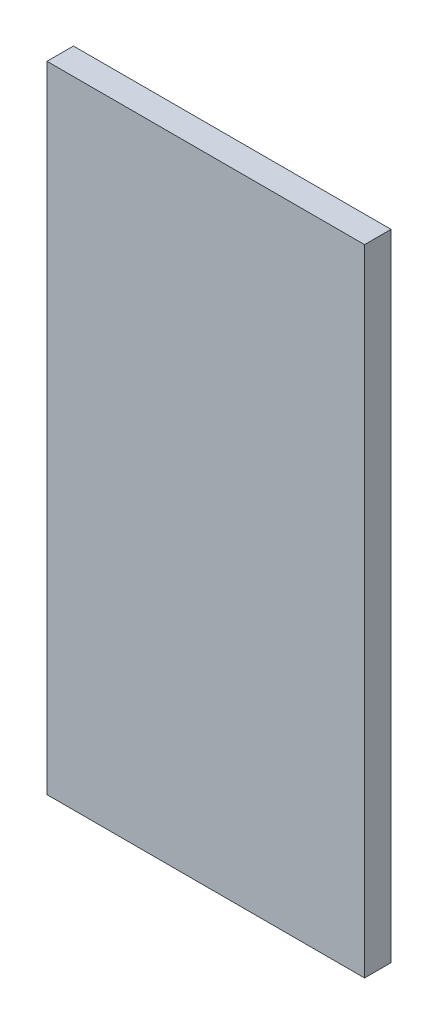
ISO-10303-21;
HEADER;
FILE_DESCRIPTION(('STEP AP214'),'2;1');
FILE_NAME('part.step','',(''),(''),'','','');
FILE_SCHEMA(('AUTOMOTIVE_DESIGN { 1 0 10303 214 1 1 1 1 }'));
ENDSEC;
DATA;
#1=APPLICATION_CONTEXT('core data for automotive mechanical design processes');
#2=APPLICATION_PROTOCOL_DEFINITION('international standard','automotive_design',2000,#1);
#3=PRODUCT_CONTEXT('',#1,'mechanical');
#4=PRODUCT('Part','Part','',(#3));
#5=PRODUCT_RELATED_PRODUCT_CATEGORY('part','',(#4));
#6=PRODUCT_DEFINITION_FORMATION('','',#4);
#7=PRODUCT_DEFINITION_CONTEXT('part definition',#1,'design');
#8=PRODUCT_DEFINITION('design','',#6,#7);
#9=PRODUCT_DEFINITION_SHAPE('','',#8);
#10=(LENGTH_UNIT() NAMED_UNIT(*) SI_UNIT(.MILLI.,.METRE.));
#11=(NAMED_UNIT(*) PLANE_ANGLE_UNIT() SI_UNIT($,.RADIAN.));
#12=(NAMED_UNIT(*) SI_UNIT($,.STERADIAN.) SOLID_ANGLE_UNIT());
#13=UNCERTAINTY_MEASURE_WITH_UNIT(LENGTH_MEASURE(1.E-05),#10,'distance_accuracy_value','');
#14=(GEOMETRIC_REPRESENTATION_CONTEXT(3) GLOBAL_UNCERTAINTY_ASSIGNED_CONTEXT((#13)) GLOBAL_UNIT_ASSIGNED_CONTEXT((#10,
#11,#12)) REPRESENTATION_CONTEXT('',''));
#15=CARTESIAN_POINT('',(0.,0.,0.));
#16=DIRECTION('',(0.,0.,1.));
#17=DIRECTION('',(1.,0.,0.));
#18=AXIS2_PLACEMENT_3D('',#15,#16,#17);
#19=CARTESIAN_POINT('',(609.6,0.,-50.8));
#20=DIRECTION('',(0.,1.,0.));
#21=DIRECTION('',(0.,0.,1.));
#22=AXIS2_PLACEMENT_3D('',#19,#20,#21);
#23=PLANE('',#22);
#24=DIRECTION('',(0.,0.,-1.));
#25=VECTOR('',#24,1.);
#26=CARTESIAN_POINT('',(0.,0.,-50.8));
#27=LINE('',#26,#25);
#28=CARTESIAN_POINT('',(0.,0.,0.));
#29=VERTEX_POINT('',#28);
#30=CARTESIAN_POINT('',(0.,0.,-50.8));
#31=VERTEX_POINT('',#30);
#32=EDGE_CURVE('E148',#29,#31,#27,.T.);
#33=ORIENTED_EDGE('',*,*,#32,.T.);
#34=DIRECTION('',(-1.,0.,0.));
#35=VECTOR('',#34,1.);
#36=CARTESIAN_POINT('',(609.6,0.,-50.8));
#37=LINE('',#36,#35);
#38=CARTESIAN_POINT('',(609.6,0.,-50.8));
#39=VERTEX_POINT('',#38);
#40=EDGE_CURVE('E11',#39,#31,#37,.T.);
#41=ORIENTED_EDGE('',*,*,#40,.F.);
#42=DIRECTION('',(0.,0.,-1.));
#43=VECTOR('',#42,1.);
#44=CARTESIAN_POINT('',(609.6,0.,-50.8));
#45=LINE('',#44,#43);
#46=CARTESIAN_POINT('',(609.6,0.,0.));
#47=VERTEX_POINT('',#46);
#48=EDGE_CURVE('E161',#47,#39,#45,.T.);
#49=ORIENTED_EDGE('',*,*,#48,.F.);
#50=DIRECTION('',(-1.,0.,0.));
#51=VECTOR('',#50,1.);
#52=CARTESIAN_POINT('',(609.6,0.,0.));
#53=LINE('',#52,#51);
#54=EDGE_CURVE('E162',#47,#29,#53,.T.);
#55=ORIENTED_EDGE('',*,*,#54,.T.);
#56=EDGE_LOOP('',(#33,#41,#49,#55));
#57=FACE_BOUND('',#56,.T.);
#58=ADVANCED_FACE('F32',(#57),#23,.F.);
#59=CARTESIAN_POINT('',(609.6,50.8,-101.6));
#60=DIRECTION('',(0.,1.,0.));
#61=DIRECTION('',(0.,0.,1.));
#62=AXIS2_PLACEMENT_3D('',#59,#60,#61);
#63=PLANE('',#62);
#64=DIRECTION('',(-1.,0.,0.));
#65=VECTOR('',#64,1.);
#66=CARTESIAN_POINT('',(609.6,50.8,-101.6));
#67=LINE('',#66,#65);
#68=CARTESIAN_POINT('',(533.4,50.8,-101.6));
#69=VERTEX_POINT('',#68);
#70=CARTESIAN_POINT('',(0.,50.8,-101.6));
#71=VERTEX_POINT('',#70);
#72=EDGE_CURVE('E129',#69,#71,#67,.T.);
#73=ORIENTED_EDGE('',*,*,#72,.F.);
#74=DIRECTION('',(0.,0.,-1.));
#75=VECTOR('',#74,1.);
#76=CARTESIAN_POINT('',(533.4,50.8,-50.8));
#77=LINE('',#76,#75);
#78=CARTESIAN_POINT('',(533.4,50.8,-50.8));
#79=VERTEX_POINT('',#78);
#80=EDGE_CURVE('E112',#79,#69,#77,.T.);
#81=ORIENTED_EDGE('',*,*,#80,.F.);
#82=DIRECTION('',(-1.,0.,0.));
#83=VECTOR('',#82,1.);
#84=CARTESIAN_POINT('',(609.6,50.8,-50.8));
#85=LINE('',#84,#83);
#86=CARTESIAN_POINT('',(0.,50.8,-50.8));
#87=VERTEX_POINT('',#86);
#88=EDGE_CURVE('E40',#79,#87,#85,.T.);
#89=ORIENTED_EDGE('',*,*,#88,.T.);
#90=DIRECTION('',(0.,0.,-1.));
#91=VECTOR('',#90,1.);
#92=CARTESIAN_POINT('',(0.,50.8,-101.6));
#93=LINE('',#92,#91);
#94=EDGE_CURVE('E141',#87,#71,#93,.T.);
#95=ORIENTED_EDGE('',*,*,#94,.T.);
#96=EDGE_LOOP('',(#73,#81,#89,#95));
#97=FACE_BOUND('',#96,.T.);
#98=ADVANCED_FACE('F139',(#97),#63,.F.);
#99=CARTESIAN_POINT('',(609.6,1168.4,-101.6));
#100=DIRECTION('',(0.,0.,1.));
#101=DIRECTION('',(0.,-1.,0.));
#102=AXIS2_PLACEMENT_3D('',#99,#100,#101);
#103=PLANE('',#102);
#104=DIRECTION('',(-1.,0.,0.));
#105=VECTOR('',#104,1.);
#106=CARTESIAN_POINT('',(609.6,1168.4,-101.6));
#107=LINE('',#106,#105);
#108=CARTESIAN_POINT('',(533.4,1168.4,-101.6));
#109=VERTEX_POINT('',#108);
#110=CARTESIAN_POINT('',(0.,1168.4,-101.6));
#111=VERTEX_POINT('',#110);
#112=EDGE_CURVE('E121',#109,#111,#107,.T.);
#113=ORIENTED_EDGE('',*,*,#112,.F.);
#114=DIRECTION('',(0.,1.,0.));
#115=VECTOR('',#114,1.);
#116=CARTESIAN_POINT('',(533.4,-0.000999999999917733,-101.6));
#117=LINE('',#116,#115);
#118=EDGE_CURVE('E106',#69,#109,#117,.T.);
#119=ORIENTED_EDGE('',*,*,#118,.F.);
#120=ORIENTED_EDGE('',*,*,#72,.T.);
#121=DIRECTION('',(0.,1.,0.));
#122=VECTOR('',#121,1.);
#123=CARTESIAN_POINT('',(0.,1168.4,-101.6));
#124=LINE('',#123,#122);
#125=EDGE_CURVE('E127',#71,#111,#124,.T.);
#126=ORIENTED_EDGE('',*,*,#125,.T.);
#127=EDGE_LOOP('',(#113,#119,#120,#126));
#128=FACE_BOUND('',#127,.T.);
#129=ADVANCED_FACE('F125',(#128),#103,.F.);
#130=CARTESIAN_POINT('',(609.6,1168.4,-50.8));
#131=DIRECTION('',(0.,-1.,0.));
#132=DIRECTION('',(0.,0.,-1.));
#133=AXIS2_PLACEMENT_3D('',#130,#131,#132);
#134=PLANE('',#133);
#135=DIRECTION('',(-1.,0.,0.));
#136=VECTOR('',#135,1.);
#137=CARTESIAN_POINT('',(609.6,1168.4,-50.8));
#138=LINE('',#137,#136);
#139=CARTESIAN_POINT('',(533.4,1168.4,-50.8));
#140=VERTEX_POINT('',#139);
#141=CARTESIAN_POINT('',(0.,1168.4,-50.8));
#142=VERTEX_POINT('',#141);
#143=EDGE_CURVE('E123',#140,#142,#138,.T.);
#144=ORIENTED_EDGE('',*,*,#143,.F.);
#145=DIRECTION('',(0.,0.,1.));
#146=VECTOR('',#145,1.);
#147=CARTESIAN_POINT('',(533.4,1168.4,-50.8));
#148=LINE('',#147,#146);
#149=EDGE_CURVE('E109',#109,#140,#148,.T.);
#150=ORIENTED_EDGE('',*,*,#149,.F.);
#151=ORIENTED_EDGE('',*,*,#112,.T.);
#152=DIRECTION('',(0.,0.,1.));
#153=VECTOR('',#152,1.);
#154=CARTESIAN_POINT('',(0.,1168.4,-50.8));
#155=LINE('',#154,#153);
#156=EDGE_CURVE('E152',#111,#142,#155,.T.);
#157=ORIENTED_EDGE('',*,*,#156,.T.);
#158=EDGE_LOOP('',(#144,#150,#151,#157));
#159=FACE_BOUND('',#158,.T.);
#160=ADVANCED_FACE('F119',(#159),#134,.F.);
#161=CARTESIAN_POINT('',(609.6,1219.2,-50.8));
#162=DIRECTION('',(0.,0.,1.));
#163=DIRECTION('',(1.,0.,0.));
#164=AXIS2_PLACEMENT_3D('',#161,#162,#163);
#165=PLANE('',#164);
#166=DIRECTION('',(0.,1.,0.));
#167=VECTOR('',#166,1.);
#168=CARTESIAN_POINT('',(0.,1219.2,-50.8));
#169=LINE('',#168,#167);
#170=CARTESIAN_POINT('',(0.,1219.2,-50.8));
#171=VERTEX_POINT('',#170);
#172=EDGE_CURVE('E157',#142,#171,#169,.T.);
#173=ORIENTED_EDGE('',*,*,#172,.T.);
#174=DIRECTION('',(-1.,0.,0.));
#175=VECTOR('',#174,1.);
#176=CARTESIAN_POINT('',(609.6,1219.2,-50.8));
#177=LINE('',#176,#175);
#178=CARTESIAN_POINT('',(609.6,1219.2,-50.8));
#179=VERTEX_POINT('',#178);
#180=EDGE_CURVE('E132',#179,#171,#177,.T.);
#181=ORIENTED_EDGE('',*,*,#180,.F.);
#182=DIRECTION('',(0.,1.,0.));
#183=VECTOR('',#182,1.);
#184=CARTESIAN_POINT('',(609.6,50.8,-50.8));
#185=LINE('',#184,#183);
#186=EDGE_CURVE('E91',#39,#179,#185,.T.);
#187=ORIENTED_EDGE('',*,*,#186,.F.);
#188=ORIENTED_EDGE('',*,*,#40,.T.);
#189=DIRECTION('',(0.,1.,0.));
#190=VECTOR('',#189,1.);
#191=CARTESIAN_POINT('',(0.,50.8,-50.8));
#192=LINE('',#191,#190);
#193=EDGE_CURVE('E142',#31,#87,#192,.T.);
#194=ORIENTED_EDGE('',*,*,#193,.T.);
#195=ORIENTED_EDGE('',*,*,#88,.F.);
#196=DIRECTION('',(0.,1.,0.));
#197=VECTOR('',#196,1.);
#198=CARTESIAN_POINT('',(533.4,-0.000999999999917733,-50.8));
#199=LINE('',#198,#197);
#200=EDGE_CURVE('E116',#79,#140,#199,.T.);
#201=ORIENTED_EDGE('',*,*,#200,.T.);
#202=ORIENTED_EDGE('',*,*,#143,.T.);
#203=EDGE_LOOP('',(#173,#181,#187,#188,#194,#195,#201,#202));
#204=FACE_BOUND('',#203,.T.);
#205=ADVANCED_FACE('F143',(#204),#165,.F.);
#206=CARTESIAN_POINT('',(609.6,1219.2,0.));
#207=DIRECTION('',(0.,-1.,0.));
#208=DIRECTION('',(0.,0.,-1.));
#209=AXIS2_PLACEMENT_3D('',#206,#207,#208);
#210=PLANE('',#209);
#211=DIRECTION('',(0.,0.,1.));
#212=VECTOR('',#211,1.);
#213=CARTESIAN_POINT('',(0.,1219.2,0.));
#214=LINE('',#213,#212);
#215=CARTESIAN_POINT('',(0.,1219.2,0.));
#216=VERTEX_POINT('',#215);
#217=EDGE_CURVE('E78',#171,#216,#214,.T.);
#218=ORIENTED_EDGE('',*,*,#217,.T.);
#219=DIRECTION('',(-1.,0.,0.));
#220=VECTOR('',#219,1.);
#221=CARTESIAN_POINT('',(609.6,1219.2,0.));
#222=LINE('',#221,#220);
#223=CARTESIAN_POINT('',(609.6,1219.2,0.));
#224=VERTEX_POINT('',#223);
#225=EDGE_CURVE('E164',#224,#216,#222,.T.);
#226=ORIENTED_EDGE('',*,*,#225,.F.);
#227=DIRECTION('',(0.,0.,1.));
#228=VECTOR('',#227,1.);
#229=CARTESIAN_POINT('',(609.6,1219.2,0.));
#230=LINE('',#229,#228);
#231=EDGE_CURVE('E167',#179,#224,#230,.T.);
#232=ORIENTED_EDGE('',*,*,#231,.F.);
#233=ORIENTED_EDGE('',*,*,#180,.T.);
#234=EDGE_LOOP('',(#218,#226,#232,#233));
#235=FACE_BOUND('',#234,.T.);
#236=ADVANCED_FACE('F166',(#235),#210,.F.);
#237=CARTESIAN_POINT('',(609.6,0.,0.));
#238=DIRECTION('',(0.,0.,-1.));
#239=DIRECTION('',(-1.,0.,0.));
#240=AXIS2_PLACEMENT_3D('',#237,#238,#239);
#241=PLANE('',#240);
#242=DIRECTION('',(0.,-1.,0.));
#243=VECTOR('',#242,1.);
#244=CARTESIAN_POINT('',(0.,0.,0.));
#245=LINE('',#244,#243);
#246=EDGE_CURVE('E84',#216,#29,#245,.T.);
#247=ORIENTED_EDGE('',*,*,#246,.T.);
#248=ORIENTED_EDGE('',*,*,#54,.F.);
#249=DIRECTION('',(0.,-1.,0.));
#250=VECTOR('',#249,1.);
#251=CARTESIAN_POINT('',(609.6,0.,0.));
#252=LINE('',#251,#250);
#253=EDGE_CURVE('E48',#224,#47,#252,.T.);
#254=ORIENTED_EDGE('',*,*,#253,.F.);
#255=ORIENTED_EDGE('',*,*,#225,.T.);
#256=EDGE_LOOP('',(#247,#248,#254,#255));
#257=FACE_BOUND('',#256,.T.);
#258=ADVANCED_FACE('F193',(#257),#241,.F.);
#259=CARTESIAN_POINT('',(609.6,0.,0.));
#260=DIRECTION('',(-1.,0.,0.));
#261=DIRECTION('',(0.,0.,1.));
#262=AXIS2_PLACEMENT_3D('',#259,#260,#261);
#263=PLANE('',#262);
#264=ORIENTED_EDGE('',*,*,#186,.T.);
#265=ORIENTED_EDGE('',*,*,#231,.T.);
#266=ORIENTED_EDGE('',*,*,#253,.T.);
#267=ORIENTED_EDGE('',*,*,#48,.T.);
#268=EDGE_LOOP('',(#264,#265,#266,#267));
#269=FACE_BOUND('',#268,.T.);
#270=ADVANCED_FACE('F177',(#269),#263,.F.);
#271=CARTESIAN_POINT('',(0.,0.,0.));
#272=DIRECTION('',(-1.,0.,0.));
#273=DIRECTION('',(0.,0.,1.));
#274=AXIS2_PLACEMENT_3D('',#271,#272,#273);
#275=PLANE('',#274);
#276=ORIENTED_EDGE('',*,*,#32,.F.);
#277=ORIENTED_EDGE('',*,*,#246,.F.);
#278=ORIENTED_EDGE('',*,*,#217,.F.);
#279=ORIENTED_EDGE('',*,*,#172,.F.);
#280=ORIENTED_EDGE('',*,*,#156,.F.);
#281=ORIENTED_EDGE('',*,*,#125,.F.);
#282=ORIENTED_EDGE('',*,*,#94,.F.);
#283=ORIENTED_EDGE('',*,*,#193,.F.);
#284=EDGE_LOOP('',(#276,#277,#278,#279,#280,#281,#282,#283));
#285=FACE_BOUND('',#284,.T.);
#286=ADVANCED_FACE('F150',(#285),#275,.T.);
#287=CARTESIAN_POINT('',(533.4,-0.000999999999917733,-50.8));
#288=DIRECTION('',(-1.,0.,0.));
#289=DIRECTION('',(0.,0.,1.));
#290=AXIS2_PLACEMENT_3D('',#287,#288,#289);
#291=PLANE('',#290);
#292=ORIENTED_EDGE('',*,*,#80,.T.);
#293=ORIENTED_EDGE('',*,*,#118,.T.);
#294=ORIENTED_EDGE('',*,*,#149,.T.);
#295=ORIENTED_EDGE('',*,*,#200,.F.);
#296=EDGE_LOOP('',(#292,#293,#294,#295));
#297=FACE_BOUND('',#296,.T.);
#298=ADVANCED_FACE('F108',(#297),#291,.F.);
#299=CLOSED_SHELL('',(#58,#98,#129,#160,#205,#236,#258,#270,#286,#298));
#300=MANIFOLD_SOLID_BREP('B2',#299);
#301=ADVANCED_BREP_SHAPE_REPRESENTATION('',(#18,#300),#14);
#302=SHAPE_DEFINITION_REPRESENTATION(#9,#301);
ENDSEC;
END-ISO-10303-21;
